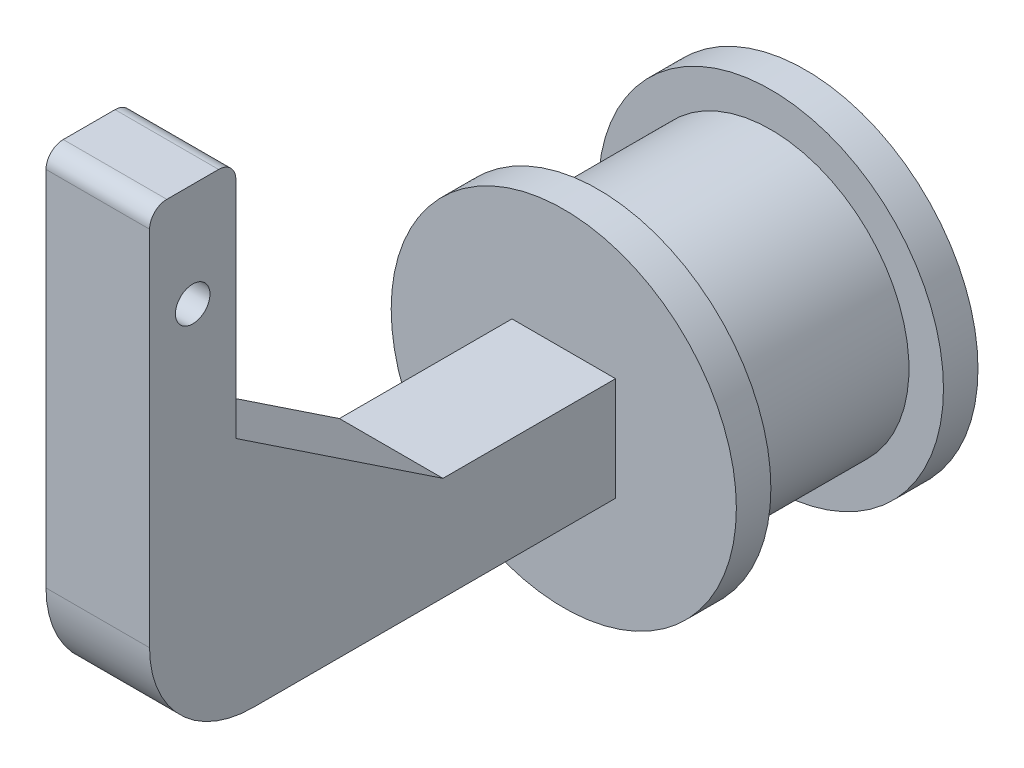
ISO-10303-21;
HEADER;
FILE_DESCRIPTION(('STEP AP214'),'2;1');
FILE_NAME('part.step','',(''),(''),'','','');
FILE_SCHEMA(('AUTOMOTIVE_DESIGN { 1 0 10303 214 1 1 1 1 }'));
ENDSEC;
DATA;
#1=APPLICATION_CONTEXT('core data for automotive mechanical design processes');
#2=APPLICATION_PROTOCOL_DEFINITION('international standard','automotive_design',2000,#1);
#3=PRODUCT_CONTEXT('',#1,'mechanical');
#4=PRODUCT('Part','Part','',(#3));
#5=PRODUCT_RELATED_PRODUCT_CATEGORY('part','',(#4));
#6=PRODUCT_DEFINITION_FORMATION('','',#4);
#7=PRODUCT_DEFINITION_CONTEXT('part definition',#1,'design');
#8=PRODUCT_DEFINITION('design','',#6,#7);
#9=PRODUCT_DEFINITION_SHAPE('','',#8);
#10=(LENGTH_UNIT() NAMED_UNIT(*) SI_UNIT(.MILLI.,.METRE.));
#11=(NAMED_UNIT(*) PLANE_ANGLE_UNIT() SI_UNIT($,.RADIAN.));
#12=(NAMED_UNIT(*) SI_UNIT($,.STERADIAN.) SOLID_ANGLE_UNIT());
#13=UNCERTAINTY_MEASURE_WITH_UNIT(LENGTH_MEASURE(1.E-05),#10,'distance_accuracy_value','');
#14=(GEOMETRIC_REPRESENTATION_CONTEXT(3) GLOBAL_UNCERTAINTY_ASSIGNED_CONTEXT((#13)) GLOBAL_UNIT_ASSIGNED_CONTEXT((#10,
#11,#12)) REPRESENTATION_CONTEXT('',''));
#15=CARTESIAN_POINT('',(0.,0.,0.));
#16=DIRECTION('',(0.,0.,1.));
#17=DIRECTION('',(1.,0.,0.));
#18=AXIS2_PLACEMENT_3D('',#15,#16,#17);
#19=CARTESIAN_POINT('',(0.,0.,30.));
#20=DIRECTION('',(0.,0.,-1.));
#21=DIRECTION('',(-1.,0.,0.));
#22=AXIS2_PLACEMENT_3D('',#19,#20,#21);
#23=CYLINDRICAL_SURFACE('',#22,40.);
#24=CARTESIAN_POINT('',(0.,0.,30.));
#25=DIRECTION('',(0.,0.,1.));
#26=DIRECTION('',(1.,0.,0.));
#27=AXIS2_PLACEMENT_3D('',#24,#25,#26);
#28=CIRCLE('',#27,40.);
#29=CARTESIAN_POINT('',(40.,0.,30.));
#30=VERTEX_POINT('',#29);
#31=EDGE_CURVE('E144',#30,#30,#28,.T.);
#32=ORIENTED_EDGE('',*,*,#31,.F.);
#33=EDGE_LOOP('',(#32));
#34=FACE_BOUND('',#33,.T.);
#35=CARTESIAN_POINT('',(0.,0.,-20.));
#36=DIRECTION('',(0.,0.,-1.));
#37=DIRECTION('',(-1.,0.,0.));
#38=AXIS2_PLACEMENT_3D('',#35,#36,#37);
#39=CIRCLE('',#38,40.);
#40=CARTESIAN_POINT('',(-40.,0.,-20.));
#41=VERTEX_POINT('',#40);
#42=EDGE_CURVE('E406',#41,#41,#39,.T.);
#43=ORIENTED_EDGE('',*,*,#42,.F.);
#44=EDGE_LOOP('',(#43));
#45=FACE_BOUND('',#44,.T.);
#46=ADVANCED_FACE('F37',(#34,#45),#23,.T.);
#47=CARTESIAN_POINT('',(0.,0.,-30.));
#48=DIRECTION('',(0.,0.,1.));
#49=DIRECTION('',(1.,0.,0.));
#50=AXIS2_PLACEMENT_3D('',#47,#48,#49);
#51=CYLINDRICAL_SURFACE('',#50,50.);
#52=CARTESIAN_POINT('',(0.,0.,-30.));
#53=DIRECTION('',(0.,0.,-1.));
#54=DIRECTION('',(-1.,0.,0.));
#55=AXIS2_PLACEMENT_3D('',#52,#53,#54);
#56=CIRCLE('',#55,50.);
#57=CARTESIAN_POINT('',(-50.,0.,-30.));
#58=VERTEX_POINT('',#57);
#59=EDGE_CURVE('E408',#58,#58,#56,.T.);
#60=ORIENTED_EDGE('',*,*,#59,.F.);
#61=EDGE_LOOP('',(#60));
#62=FACE_BOUND('',#61,.T.);
#63=CARTESIAN_POINT('',(0.,0.,-20.));
#64=DIRECTION('',(0.,0.,-1.));
#65=DIRECTION('',(-1.,0.,0.));
#66=AXIS2_PLACEMENT_3D('',#63,#64,#65);
#67=CIRCLE('',#66,50.);
#68=CARTESIAN_POINT('',(-50.,0.,-20.));
#69=VERTEX_POINT('',#68);
#70=EDGE_CURVE('E412',#69,#69,#67,.T.);
#71=ORIENTED_EDGE('',*,*,#70,.T.);
#72=EDGE_LOOP('',(#71));
#73=FACE_BOUND('',#72,.T.);
#74=ADVANCED_FACE('F232',(#62,#73),#51,.T.);
#75=CARTESIAN_POINT('',(0.,0.,-30.));
#76=DIRECTION('',(0.,0.,-1.));
#77=DIRECTION('',(-1.,0.,0.));
#78=AXIS2_PLACEMENT_3D('',#75,#76,#77);
#79=PLANE('',#78);
#80=ORIENTED_EDGE('',*,*,#59,.T.);
#81=EDGE_LOOP('',(#80));
#82=FACE_BOUND('',#81,.T.);
#83=ADVANCED_FACE('F238',(#82),#79,.T.);
#84=CARTESIAN_POINT('',(0.,0.,-20.));
#85=DIRECTION('',(0.,0.,-1.));
#86=DIRECTION('',(-1.,0.,0.));
#87=AXIS2_PLACEMENT_3D('',#84,#85,#86);
#88=PLANE('',#87);
#89=ORIENTED_EDGE('',*,*,#42,.T.);
#90=EDGE_LOOP('',(#89));
#91=FACE_BOUND('',#90,.T.);
#92=ORIENTED_EDGE('',*,*,#70,.F.);
#93=EDGE_LOOP('',(#92));
#94=FACE_BOUND('',#93,.T.);
#95=ADVANCED_FACE('F327',(#91,#94),#88,.F.);
#96=CARTESIAN_POINT('',(0.,0.,40.));
#97=DIRECTION('',(0.,0.,1.));
#98=DIRECTION('',(1.,0.,0.));
#99=AXIS2_PLACEMENT_3D('',#96,#97,#98);
#100=PLANE('',#99);
#101=CARTESIAN_POINT('',(0.,0.,40.));
#102=DIRECTION('',(0.,0.,1.));
#103=DIRECTION('',(1.,0.,0.));
#104=AXIS2_PLACEMENT_3D('',#101,#102,#103);
#105=CIRCLE('',#104,50.);
#106=CARTESIAN_POINT('',(50.,0.,40.));
#107=VERTEX_POINT('',#106);
#108=EDGE_CURVE('E128',#107,#107,#105,.T.);
#109=ORIENTED_EDGE('',*,*,#108,.T.);
#110=EDGE_LOOP('',(#109));
#111=FACE_BOUND('',#110,.T.);
#112=DIRECTION('',(0.,1.,0.));
#113=VECTOR('',#112,1.);
#114=CARTESIAN_POINT('',(15.,15.,40.));
#115=LINE('',#114,#113);
#116=CARTESIAN_POINT('',(15.,-15.,40.));
#117=VERTEX_POINT('',#116);
#118=CARTESIAN_POINT('',(15.,15.,40.));
#119=VERTEX_POINT('',#118);
#120=EDGE_CURVE('E52',#117,#119,#115,.T.);
#121=ORIENTED_EDGE('',*,*,#120,.F.);
#122=DIRECTION('',(1.,0.,0.));
#123=VECTOR('',#122,1.);
#124=CARTESIAN_POINT('',(-15.,-15.,40.));
#125=LINE('',#124,#123);
#126=CARTESIAN_POINT('',(-15.,-15.,40.));
#127=VERTEX_POINT('',#126);
#128=EDGE_CURVE('E11',#127,#117,#125,.T.);
#129=ORIENTED_EDGE('',*,*,#128,.F.);
#130=DIRECTION('',(0.,-1.,0.));
#131=VECTOR('',#130,1.);
#132=CARTESIAN_POINT('',(-15.,15.,40.));
#133=LINE('',#132,#131);
#134=CARTESIAN_POINT('',(-15.,15.,40.));
#135=VERTEX_POINT('',#134);
#136=EDGE_CURVE('E111',#135,#127,#133,.T.);
#137=ORIENTED_EDGE('',*,*,#136,.F.);
#138=DIRECTION('',(-1.,0.,0.));
#139=VECTOR('',#138,1.);
#140=CARTESIAN_POINT('',(-15.,15.,40.));
#141=LINE('',#140,#139);
#142=EDGE_CURVE('E127',#119,#135,#141,.T.);
#143=ORIENTED_EDGE('',*,*,#142,.F.);
#144=EDGE_LOOP('',(#121,#129,#137,#143));
#145=FACE_BOUND('',#144,.T.);
#146=ADVANCED_FACE('F110',(#111,#145),#100,.T.);
#147=CARTESIAN_POINT('',(0.,0.,30.));
#148=DIRECTION('',(0.,0.,1.));
#149=DIRECTION('',(1.,0.,0.));
#150=AXIS2_PLACEMENT_3D('',#147,#148,#149);
#151=PLANE('',#150);
#152=CARTESIAN_POINT('',(0.,0.,30.));
#153=DIRECTION('',(0.,0.,1.));
#154=DIRECTION('',(1.,0.,0.));
#155=AXIS2_PLACEMENT_3D('',#152,#153,#154);
#156=CIRCLE('',#155,50.);
#157=CARTESIAN_POINT('',(50.,0.,30.));
#158=VERTEX_POINT('',#157);
#159=EDGE_CURVE('E419',#158,#158,#156,.T.);
#160=ORIENTED_EDGE('',*,*,#159,.F.);
#161=EDGE_LOOP('',(#160));
#162=FACE_BOUND('',#161,.T.);
#163=ORIENTED_EDGE('',*,*,#31,.T.);
#164=EDGE_LOOP('',(#163));
#165=FACE_BOUND('',#164,.T.);
#166=ADVANCED_FACE('F307',(#162,#165),#151,.F.);
#167=CARTESIAN_POINT('',(0.,0.,40.));
#168=DIRECTION('',(0.,0.,-1.));
#169=DIRECTION('',(-1.,0.,0.));
#170=AXIS2_PLACEMENT_3D('',#167,#168,#169);
#171=CYLINDRICAL_SURFACE('',#170,50.);
#172=ORIENTED_EDGE('',*,*,#108,.F.);
#173=EDGE_LOOP('',(#172));
#174=FACE_BOUND('',#173,.T.);
#175=ORIENTED_EDGE('',*,*,#159,.T.);
#176=EDGE_LOOP('',(#175));
#177=FACE_BOUND('',#176,.T.);
#178=ADVANCED_FACE('F302',(#174,#177),#171,.T.);
#179=CARTESIAN_POINT('',(15.,95.,162.5));
#180=DIRECTION('',(-1.,0.,0.));
#181=DIRECTION('',(0.,0.,1.));
#182=AXIS2_PLACEMENT_3D('',#179,#180,#181);
#183=CYLINDRICAL_SURFACE('',#182,4.99999999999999);
#184=CARTESIAN_POINT('',(15.,95.,162.5));
#185=DIRECTION('',(-1.,0.,0.));
#186=DIRECTION('',(0.,0.,1.));
#187=AXIS2_PLACEMENT_3D('',#184,#185,#186);
#188=CIRCLE('',#187,4.99999999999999);
#189=CARTESIAN_POINT('',(15.,95.,167.5));
#190=VERTEX_POINT('',#189);
#191=EDGE_CURVE('E184',#190,#190,#188,.T.);
#192=ORIENTED_EDGE('',*,*,#191,.F.);
#193=EDGE_LOOP('',(#192));
#194=FACE_BOUND('',#193,.T.);
#195=CARTESIAN_POINT('',(-15.,95.,162.5));
#196=DIRECTION('',(-1.,0.,0.));
#197=DIRECTION('',(0.,0.,1.));
#198=AXIS2_PLACEMENT_3D('',#195,#196,#197);
#199=CIRCLE('',#198,4.99999999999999);
#200=CARTESIAN_POINT('',(-15.,95.,167.5));
#201=VERTEX_POINT('',#200);
#202=EDGE_CURVE('E189',#201,#201,#199,.T.);
#203=ORIENTED_EDGE('',*,*,#202,.T.);
#204=EDGE_LOOP('',(#203));
#205=FACE_BOUND('',#204,.T.);
#206=ADVANCED_FACE('F265',(#194,#205),#183,.F.);
#207=CARTESIAN_POINT('',(15.,15.,90.));
#208=DIRECTION('',(0.,0.832050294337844,-0.554700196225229));
#209=DIRECTION('',(0.,0.554700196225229,0.832050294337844));
#210=AXIS2_PLACEMENT_3D('',#207,#208,#209);
#211=PLANE('',#210);
#212=DIRECTION('',(0.,-0.554700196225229,-0.832050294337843));
#213=VECTOR('',#212,1.);
#214=CARTESIAN_POINT('',(-15.,15.,90.));
#215=LINE('',#214,#213);
#216=CARTESIAN_POINT('',(-15.,55.,150.));
#217=VERTEX_POINT('',#216);
#218=CARTESIAN_POINT('',(-15.,15.,90.));
#219=VERTEX_POINT('',#218);
#220=EDGE_CURVE('E194',#217,#219,#215,.T.);
#221=ORIENTED_EDGE('',*,*,#220,.F.);
#222=DIRECTION('',(-1.,0.,0.));
#223=VECTOR('',#222,1.);
#224=CARTESIAN_POINT('',(15.,55.,150.));
#225=LINE('',#224,#223);
#226=CARTESIAN_POINT('',(15.,55.,150.));
#227=VERTEX_POINT('',#226);
#228=EDGE_CURVE('E202',#227,#217,#225,.T.);
#229=ORIENTED_EDGE('',*,*,#228,.F.);
#230=DIRECTION('',(0.,-0.554700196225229,-0.832050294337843));
#231=VECTOR('',#230,1.);
#232=CARTESIAN_POINT('',(15.,15.,90.));
#233=LINE('',#232,#231);
#234=CARTESIAN_POINT('',(15.,15.,90.));
#235=VERTEX_POINT('',#234);
#236=EDGE_CURVE('E200',#227,#235,#233,.T.);
#237=ORIENTED_EDGE('',*,*,#236,.T.);
#238=DIRECTION('',(-1.,0.,0.));
#239=VECTOR('',#238,1.);
#240=CARTESIAN_POINT('',(15.,15.,90.));
#241=LINE('',#240,#239);
#242=EDGE_CURVE('E138',#235,#219,#241,.T.);
#243=ORIENTED_EDGE('',*,*,#242,.T.);
#244=EDGE_LOOP('',(#221,#229,#237,#243));
#245=FACE_BOUND('',#244,.T.);
#246=ADVANCED_FACE('F213',(#245),#211,.T.);
#247=CARTESIAN_POINT('',(-15.,125.,150.));
#248=DIRECTION('',(0.,0.,-1.));
#249=DIRECTION('',(-1.,0.,0.));
#250=AXIS2_PLACEMENT_3D('',#247,#248,#249);
#251=PLANE('',#250);
#252=DIRECTION('',(0.,-1.,0.));
#253=VECTOR('',#252,1.);
#254=CARTESIAN_POINT('',(-15.,125.,150.));
#255=LINE('',#254,#253);
#256=CARTESIAN_POINT('',(-15.,120.,150.));
#257=VERTEX_POINT('',#256);
#258=EDGE_CURVE('E186',#257,#217,#255,.T.);
#259=ORIENTED_EDGE('',*,*,#258,.F.);
#260=DIRECTION('',(1.,0.,0.));
#261=VECTOR('',#260,1.);
#262=CARTESIAN_POINT('',(-15.,120.,150.));
#263=LINE('',#262,#261);
#264=CARTESIAN_POINT('',(15.,120.,150.));
#265=VERTEX_POINT('',#264);
#266=EDGE_CURVE('E155',#257,#265,#263,.T.);
#267=ORIENTED_EDGE('',*,*,#266,.T.);
#268=DIRECTION('',(0.,-1.,0.));
#269=VECTOR('',#268,1.);
#270=CARTESIAN_POINT('',(15.,125.,150.));
#271=LINE('',#270,#269);
#272=EDGE_CURVE('E197',#265,#227,#271,.T.);
#273=ORIENTED_EDGE('',*,*,#272,.T.);
#274=ORIENTED_EDGE('',*,*,#228,.T.);
#275=EDGE_LOOP('',(#259,#267,#273,#274));
#276=FACE_BOUND('',#275,.T.);
#277=ADVANCED_FACE('F208',(#276),#251,.T.);
#278=CARTESIAN_POINT('',(-15.,120.,155.));
#279=DIRECTION('',(1.,0.,0.));
#280=DIRECTION('',(0.,0.,-1.));
#281=AXIS2_PLACEMENT_3D('',#278,#279,#280);
#282=CYLINDRICAL_SURFACE('',#281,5.);
#283=ORIENTED_EDGE('',*,*,#266,.F.);
#284=CARTESIAN_POINT('',(-15.,120.,155.));
#285=DIRECTION('',(1.,0.,0.));
#286=DIRECTION('',(0.,1.,0.));
#287=AXIS2_PLACEMENT_3D('',#284,#285,#286);
#288=CIRCLE('',#287,5.);
#289=CARTESIAN_POINT('',(-15.,125.,155.));
#290=VERTEX_POINT('',#289);
#291=EDGE_CURVE('E161',#290,#257,#288,.F.);
#292=ORIENTED_EDGE('',*,*,#291,.F.);
#293=DIRECTION('',(1.,0.,0.));
#294=VECTOR('',#293,1.);
#295=CARTESIAN_POINT('',(0.,125.,155.));
#296=LINE('',#295,#294);
#297=CARTESIAN_POINT('',(15.,125.,155.));
#298=VERTEX_POINT('',#297);
#299=EDGE_CURVE('E158',#298,#290,#296,.F.);
#300=ORIENTED_EDGE('',*,*,#299,.F.);
#301=CARTESIAN_POINT('',(15.,120.,155.));
#302=DIRECTION('',(-1.,0.,0.));
#303=DIRECTION('',(0.,-1.,0.));
#304=AXIS2_PLACEMENT_3D('',#301,#302,#303);
#305=CIRCLE('',#304,5.);
#306=EDGE_CURVE('E163',#265,#298,#305,.F.);
#307=ORIENTED_EDGE('',*,*,#306,.F.);
#308=EDGE_LOOP('',(#283,#292,#300,#307));
#309=FACE_BOUND('',#308,.T.);
#310=ADVANCED_FACE('F222',(#309),#282,.T.);
#311=CARTESIAN_POINT('',(0.,125.,0.));
#312=DIRECTION('',(0.,1.,0.));
#313=DIRECTION('',(0.,0.,1.));
#314=AXIS2_PLACEMENT_3D('',#311,#312,#313);
#315=PLANE('',#314);
#316=DIRECTION('',(0.,0.,-1.));
#317=VECTOR('',#316,1.);
#318=CARTESIAN_POINT('',(-15.,125.,150.));
#319=LINE('',#318,#317);
#320=CARTESIAN_POINT('',(-15.,125.,170.));
#321=VERTEX_POINT('',#320);
#322=EDGE_CURVE('E175',#321,#290,#319,.T.);
#323=ORIENTED_EDGE('',*,*,#322,.F.);
#324=DIRECTION('',(1.,0.,0.));
#325=VECTOR('',#324,1.);
#326=CARTESIAN_POINT('',(0.,125.,170.));
#327=LINE('',#326,#325);
#328=CARTESIAN_POINT('',(15.,125.,170.));
#329=VERTEX_POINT('',#328);
#330=EDGE_CURVE('E165',#321,#329,#327,.T.);
#331=ORIENTED_EDGE('',*,*,#330,.T.);
#332=DIRECTION('',(0.,0.,1.));
#333=VECTOR('',#332,1.);
#334=CARTESIAN_POINT('',(15.,125.,150.));
#335=LINE('',#334,#333);
#336=EDGE_CURVE('E183',#298,#329,#335,.T.);
#337=ORIENTED_EDGE('',*,*,#336,.F.);
#338=ORIENTED_EDGE('',*,*,#299,.T.);
#339=EDGE_LOOP('',(#323,#331,#337,#338));
#340=FACE_BOUND('',#339,.T.);
#341=ADVANCED_FACE('F181',(#340),#315,.T.);
#342=CARTESIAN_POINT('',(0.,120.,170.));
#343=DIRECTION('',(1.,0.,0.));
#344=DIRECTION('',(0.,0.,-1.));
#345=AXIS2_PLACEMENT_3D('',#342,#343,#344);
#346=CYLINDRICAL_SURFACE('',#345,5.);
#347=ORIENTED_EDGE('',*,*,#330,.F.);
#348=CARTESIAN_POINT('',(-15.,120.,170.));
#349=DIRECTION('',(1.,0.,0.));
#350=DIRECTION('',(0.,1.,0.));
#351=AXIS2_PLACEMENT_3D('',#348,#349,#350);
#352=CIRCLE('',#351,5.);
#353=CARTESIAN_POINT('',(-15.,120.,175.));
#354=VERTEX_POINT('',#353);
#355=EDGE_CURVE('E171',#354,#321,#352,.F.);
#356=ORIENTED_EDGE('',*,*,#355,.F.);
#357=DIRECTION('',(1.,0.,0.));
#358=VECTOR('',#357,1.);
#359=CARTESIAN_POINT('',(-15.,120.,175.));
#360=LINE('',#359,#358);
#361=CARTESIAN_POINT('',(15.,120.,175.));
#362=VERTEX_POINT('',#361);
#363=EDGE_CURVE('E168',#362,#354,#360,.F.);
#364=ORIENTED_EDGE('',*,*,#363,.F.);
#365=CARTESIAN_POINT('',(15.,120.,170.));
#366=DIRECTION('',(-1.,0.,0.));
#367=DIRECTION('',(0.,-1.,0.));
#368=AXIS2_PLACEMENT_3D('',#365,#366,#367);
#369=CIRCLE('',#368,5.);
#370=EDGE_CURVE('E45',#329,#362,#369,.F.);
#371=ORIENTED_EDGE('',*,*,#370,.F.);
#372=EDGE_LOOP('',(#347,#356,#364,#371));
#373=FACE_BOUND('',#372,.T.);
#374=ADVANCED_FACE('F39',(#373),#346,.T.);
#375=CARTESIAN_POINT('',(-15.,125.,175.));
#376=DIRECTION('',(0.,0.,1.));
#377=DIRECTION('',(1.,0.,0.));
#378=AXIS2_PLACEMENT_3D('',#375,#376,#377);
#379=PLANE('',#378);
#380=DIRECTION('',(0.,-1.,0.));
#381=VECTOR('',#380,1.);
#382=CARTESIAN_POINT('',(15.,125.,175.));
#383=LINE('',#382,#381);
#384=CARTESIAN_POINT('',(15.,15.,175.));
#385=VERTEX_POINT('',#384);
#386=EDGE_CURVE('E195',#362,#385,#383,.T.);
#387=ORIENTED_EDGE('',*,*,#386,.F.);
#388=ORIENTED_EDGE('',*,*,#363,.T.);
#389=DIRECTION('',(0.,-1.,0.));
#390=VECTOR('',#389,1.);
#391=CARTESIAN_POINT('',(-15.,125.,175.));
#392=LINE('',#391,#390);
#393=CARTESIAN_POINT('',(-15.,15.,175.));
#394=VERTEX_POINT('',#393);
#395=EDGE_CURVE('E177',#354,#394,#392,.T.);
#396=ORIENTED_EDGE('',*,*,#395,.T.);
#397=DIRECTION('',(1.,0.,0.));
#398=VECTOR('',#397,1.);
#399=CARTESIAN_POINT('',(-15.,15.,175.));
#400=LINE('',#399,#398);
#401=EDGE_CURVE('E147',#394,#385,#400,.T.);
#402=ORIENTED_EDGE('',*,*,#401,.T.);
#403=EDGE_LOOP('',(#387,#388,#396,#402));
#404=FACE_BOUND('',#403,.T.);
#405=ADVANCED_FACE('F247',(#404),#379,.T.);
#406=CARTESIAN_POINT('',(-15.,15.,145.));
#407=DIRECTION('',(-1.,0.,0.));
#408=DIRECTION('',(0.,0.,1.));
#409=AXIS2_PLACEMENT_3D('',#406,#407,#408);
#410=CYLINDRICAL_SURFACE('',#409,30.);
#411=ORIENTED_EDGE('',*,*,#401,.F.);
#412=CARTESIAN_POINT('',(-15.,15.,145.));
#413=DIRECTION('',(1.,0.,0.));
#414=DIRECTION('',(0.,1.,0.));
#415=AXIS2_PLACEMENT_3D('',#412,#413,#414);
#416=CIRCLE('',#415,30.);
#417=CARTESIAN_POINT('',(-15.,-15.,145.));
#418=VERTEX_POINT('',#417);
#419=EDGE_CURVE('E151',#418,#394,#416,.F.);
#420=ORIENTED_EDGE('',*,*,#419,.F.);
#421=DIRECTION('',(1.,0.,0.));
#422=VECTOR('',#421,1.);
#423=CARTESIAN_POINT('',(-15.,-15.,145.));
#424=LINE('',#423,#422);
#425=CARTESIAN_POINT('',(15.,-15.,145.));
#426=VERTEX_POINT('',#425);
#427=EDGE_CURVE('E133',#426,#418,#424,.F.);
#428=ORIENTED_EDGE('',*,*,#427,.F.);
#429=CARTESIAN_POINT('',(15.,15.,145.));
#430=DIRECTION('',(-1.,0.,0.));
#431=DIRECTION('',(0.,-1.,0.));
#432=AXIS2_PLACEMENT_3D('',#429,#430,#431);
#433=CIRCLE('',#432,30.);
#434=EDGE_CURVE('E153',#385,#426,#433,.F.);
#435=ORIENTED_EDGE('',*,*,#434,.F.);
#436=EDGE_LOOP('',(#411,#420,#428,#435));
#437=FACE_BOUND('',#436,.T.);
#438=ADVANCED_FACE('F245',(#437),#410,.T.);
#439=CARTESIAN_POINT('',(-15.,-15.,150.));
#440=DIRECTION('',(0.,1.,0.));
#441=DIRECTION('',(0.,0.,1.));
#442=AXIS2_PLACEMENT_3D('',#439,#440,#441);
#443=PLANE('',#442);
#444=DIRECTION('',(0.,0.,-1.));
#445=VECTOR('',#444,1.);
#446=CARTESIAN_POINT('',(-15.,-15.,150.));
#447=LINE('',#446,#445);
#448=EDGE_CURVE('E123',#418,#127,#447,.T.);
#449=ORIENTED_EDGE('',*,*,#448,.T.);
#450=ORIENTED_EDGE('',*,*,#128,.T.);
#451=DIRECTION('',(0.,0.,-1.));
#452=VECTOR('',#451,1.);
#453=CARTESIAN_POINT('',(15.,-15.,150.));
#454=LINE('',#453,#452);
#455=EDGE_CURVE('E134',#426,#117,#454,.T.);
#456=ORIENTED_EDGE('',*,*,#455,.F.);
#457=ORIENTED_EDGE('',*,*,#427,.T.);
#458=EDGE_LOOP('',(#449,#450,#456,#457));
#459=FACE_BOUND('',#458,.T.);
#460=ADVANCED_FACE('F131',(#459),#443,.F.);
#461=CARTESIAN_POINT('',(-15.,15.,150.));
#462=DIRECTION('',(1.,0.,0.));
#463=DIRECTION('',(0.,1.,0.));
#464=AXIS2_PLACEMENT_3D('',#461,#462,#463);
#465=PLANE('',#464);
#466=DIRECTION('',(0.,0.,-1.));
#467=VECTOR('',#466,1.);
#468=CARTESIAN_POINT('',(-15.,15.,150.));
#469=LINE('',#468,#467);
#470=EDGE_CURVE('E126',#219,#135,#469,.T.);
#471=ORIENTED_EDGE('',*,*,#470,.T.);
#472=ORIENTED_EDGE('',*,*,#136,.T.);
#473=ORIENTED_EDGE('',*,*,#448,.F.);
#474=ORIENTED_EDGE('',*,*,#419,.T.);
#475=ORIENTED_EDGE('',*,*,#395,.F.);
#476=ORIENTED_EDGE('',*,*,#355,.T.);
#477=ORIENTED_EDGE('',*,*,#322,.T.);
#478=ORIENTED_EDGE('',*,*,#291,.T.);
#479=ORIENTED_EDGE('',*,*,#258,.T.);
#480=ORIENTED_EDGE('',*,*,#220,.T.);
#481=EDGE_LOOP('',(#471,#472,#473,#474,#475,#476,#477,#478,#479,#480));
#482=FACE_BOUND('',#481,.T.);
#483=ORIENTED_EDGE('',*,*,#202,.F.);
#484=EDGE_LOOP('',(#483));
#485=FACE_BOUND('',#484,.T.);
#486=ADVANCED_FACE('F120',(#482,#485),#465,.F.);
#487=CARTESIAN_POINT('',(-15.,15.,150.));
#488=DIRECTION('',(0.,-1.,0.));
#489=DIRECTION('',(0.,0.,-1.));
#490=AXIS2_PLACEMENT_3D('',#487,#488,#489);
#491=PLANE('',#490);
#492=DIRECTION('',(0.,0.,-1.));
#493=VECTOR('',#492,1.);
#494=CARTESIAN_POINT('',(15.,15.,150.));
#495=LINE('',#494,#493);
#496=EDGE_CURVE('E136',#235,#119,#495,.T.);
#497=ORIENTED_EDGE('',*,*,#496,.T.);
#498=ORIENTED_EDGE('',*,*,#142,.T.);
#499=ORIENTED_EDGE('',*,*,#470,.F.);
#500=ORIENTED_EDGE('',*,*,#242,.F.);
#501=EDGE_LOOP('',(#497,#498,#499,#500));
#502=FACE_BOUND('',#501,.T.);
#503=ADVANCED_FACE('F219',(#502),#491,.F.);
#504=CARTESIAN_POINT('',(15.,15.,150.));
#505=DIRECTION('',(-1.,0.,0.));
#506=DIRECTION('',(0.,-1.,0.));
#507=AXIS2_PLACEMENT_3D('',#504,#505,#506);
#508=PLANE('',#507);
#509=ORIENTED_EDGE('',*,*,#455,.T.);
#510=ORIENTED_EDGE('',*,*,#120,.T.);
#511=ORIENTED_EDGE('',*,*,#496,.F.);
#512=ORIENTED_EDGE('',*,*,#236,.F.);
#513=ORIENTED_EDGE('',*,*,#272,.F.);
#514=ORIENTED_EDGE('',*,*,#306,.T.);
#515=ORIENTED_EDGE('',*,*,#336,.T.);
#516=ORIENTED_EDGE('',*,*,#370,.T.);
#517=ORIENTED_EDGE('',*,*,#386,.T.);
#518=ORIENTED_EDGE('',*,*,#434,.T.);
#519=EDGE_LOOP('',(#509,#510,#511,#512,#513,#514,#515,#516,#517,#518));
#520=FACE_BOUND('',#519,.T.);
#521=ORIENTED_EDGE('',*,*,#191,.T.);
#522=EDGE_LOOP('',(#521));
#523=FACE_BOUND('',#522,.T.);
#524=ADVANCED_FACE('F216',(#520,#523),#508,.F.);
#525=CLOSED_SHELL('',(#46,#74,#83,#95,#146,#166,#178,#206,#246,#277,#310,#341,#374,#405,#438,
#460,#486,#503,#524));
#526=MANIFOLD_SOLID_BREP('B2',#525);
#527=ADVANCED_BREP_SHAPE_REPRESENTATION('',(#18,#526),#14);
#528=SHAPE_DEFINITION_REPRESENTATION(#9,#527);
ENDSEC;
END-ISO-10303-21;
